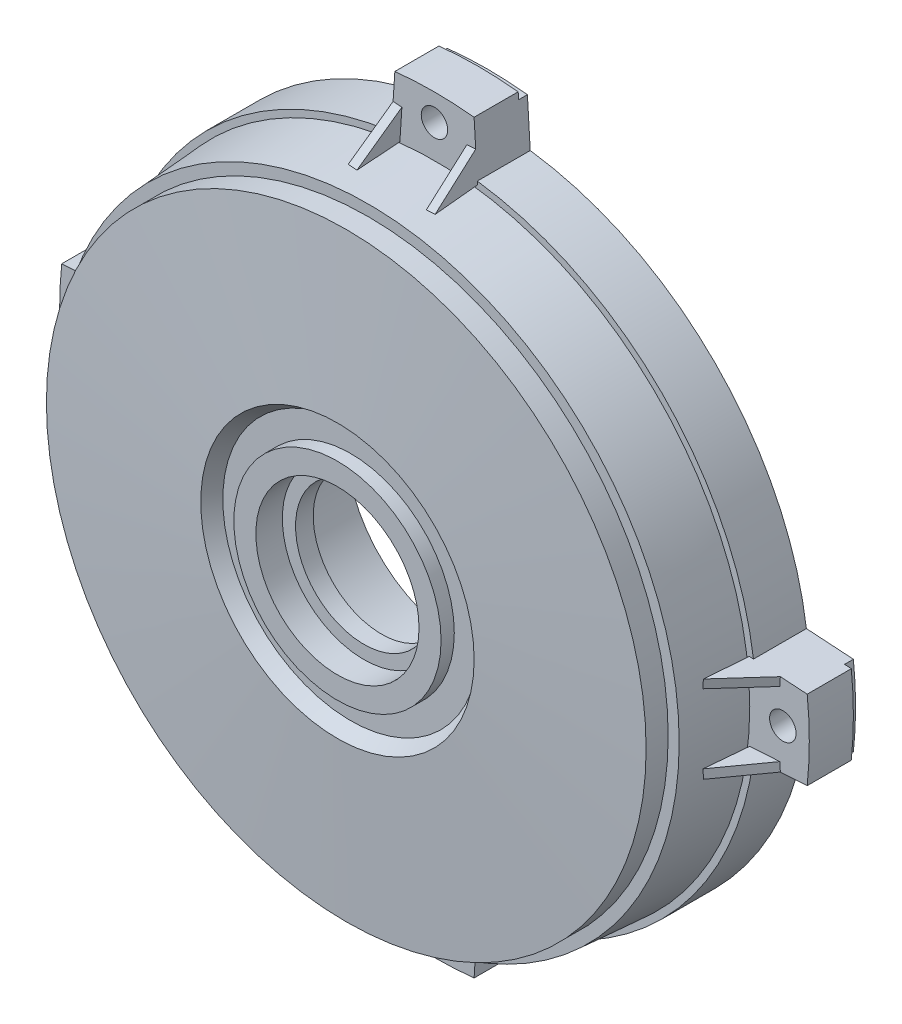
from build123d import *

# Parameters (mm, degrees)
SKETCH_2_R                = 70
CUT_EXTRUDE_1_DEPTH       = 4
EXTRUDE_1_DEPTH           = 12
PATTERN_CIRCULAR_1_COUNT  = 4
SKETCH_4_OUTSIDE_W        = 220.562
SKETCH_4_OUTSIDE_H        = 220.562
SKETCH_4_OUTSIDE_R        = 83.5
CUT_EXTRUDE_2_DEPTH       = 2
SKETCH_5_R                = 3
CUT_EXTRUDE_3_DEPTH       = 125.923976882
SKETCH_7_W                = 3
SKETCH_7_H                = 4
PATTERN_CIRCULAR_3_COUNT  = 8
SKETCH_8_R                = 5
EXTRUDE_2_DEPTH           = 22
PATTERN_CIRCULAR_4_COUNT  = 3
PATTERN_CIRCULAR_5_COUNT  = 3
EXTRUDE_3_DEPTH           = 2
PATTERN_CIRCULAR_7_COUNT  = 4
EXTRUDE_4_DEPTH           = 2
PATTERN_CIRCULAR_12_COUNT = 4


with BuildPart() as part:
    # Sketch 1 → Revolve 1 (revolve)
    with BuildSketch(Plane(origin=(0, 0, 0), x_dir=(1, 0, 0), z_dir=(0, 1, 0))):
        with BuildLine():
            Line((15.5, 5.088378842), (22.5, 5.088378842))
            Line((22.5, 5.088378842), (22.5, 6.088378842))
            Line((22.5, 6.088378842), (26, 6.088378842))
            Line((26, 6.088378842), (26, 23.088378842))
            Line((26, 23.088378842), (34, 23.088378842))
            Line((34, 23.088378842), (34, 4.03322004))
            ThreePointArc((34, 4.03322004), (35.561205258, 0.403524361), (39.26987629, -0.959491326))
            Line((39.26987629, -0.959491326), (64.5, 0.404299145))
            Line((64.5, 0.404299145), (64.5, 5.588378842))
            Line((64.5, 5.588378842), (67.233333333, 5.588378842))
            Line((67.233333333, 5.588378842), (70, 29.088378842))
            Line((70, 29.088378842), (73, 29.088378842))
            Line((73, 29.088378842), (73, 17.088378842))
            Line((73, 17.088378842), (71.5, 17.088378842))
            Line((71.5, 17.088378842), (70.5, 2.088378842))
            Line((70.5, 2.088378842), (68, 2.088378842))
            Line((68, 2.088378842), (68, -2.911621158))
            Line((68, -2.911621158), (31, -4.911621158))
            Line((31, -4.911621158), (29, -1.911621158))
            Line((29, -1.911621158), (23.5, -1.911621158))
            Line((23.5, -1.911621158), (23.5, -4.911621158))
            Line((23.5, -4.911621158), (18.5, -4.911621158))
            Line((18.5, -4.911621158), (18.5, 1.088378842))
            Line((18.5, 1.088378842), (15.5, 1.088378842))
            Line((15.5, 1.088378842), (15.5, 5.088378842))
        make_face()
    revolve(axis=Axis((0, 0, 0), (0, 0, -1)))

    # Sketch 2 → Cut-Extrude 1 (cut)
    with BuildSketch(Plane(origin=(0, 0, -29.088378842), x_dir=(-1, 0, 0), z_dir=(0, 0, -1))):
        Circle(SKETCH_2_R)
    extrude(amount=-CUT_EXTRUDE_1_DEPTH, mode=Mode.SUBTRACT)

    # Sketch 3 → Extrude 1 (add)
    with BuildSketch(Plane(origin=(0, 0, -29.088378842), x_dir=(-1, 0, 0), z_dir=(0, 0, -1))):
        with BuildLine():
            Line((-8.987378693, 84.523529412), (-9.900914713, 69.296261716))
            ThreePointArc((-9.900914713, 69.296261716), (0.037147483, 69.999990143), (9.974457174, 69.285714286))
            Line((9.974457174, 69.285714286), (8.987378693, 84.523529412))
            ThreePointArc((8.987378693, 84.523529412), (0, 85), (-8.987378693, 84.523529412))
        make_face()
    extrude_1 = extrude(amount=-EXTRUDE_1_DEPTH)

    # Pattern Circular 1: Extrude 1 ×4 about axis
    pattern_circular_1_axis = Axis((0, 0, 0), (0, 0, 1))
    for i in range(1, PATTERN_CIRCULAR_1_COUNT):
        add(extrude_1.rotate(pattern_circular_1_axis, i * 360 / PATTERN_CIRCULAR_1_COUNT))

    # Sketch 4 outside → Cut-Extrude 2 (cut)
    with BuildSketch(Plane(origin=(0, 0, -29.088378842), x_dir=(-1, 0, 0), z_dir=(0, 0, -1))):
        Rectangle(SKETCH_4_OUTSIDE_W, SKETCH_4_OUTSIDE_H)
        Circle(SKETCH_4_OUTSIDE_R, mode=Mode.SUBTRACT)
    extrude(amount=-CUT_EXTRUDE_2_DEPTH, mode=Mode.SUBTRACT)

    # Sketch 5 → Cut-Extrude 3 (cut, through all)
    with BuildSketch(Plane(origin=(0, 0, -29.088378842), x_dir=(-1, 0, 0), z_dir=(0, 0, -1))):
        with Locations((0, 79)):
            Circle(SKETCH_5_R)
        with Locations((79, 0)):
            Circle(SKETCH_5_R)
        with Locations((0, -79)):
            Circle(SKETCH_5_R)
        with Locations((-79, 0)):
            Circle(SKETCH_5_R)
    extrude(amount=-CUT_EXTRUDE_3_DEPTH, mode=Mode.SUBTRACT)

    # Sweep 1: sweep along a path in Sketch 6
    with BuildLine(Plane(origin=(0, 0, 0), x_dir=(1, 0, 0), z_dir=(0, 1, 0))) as sweep_1_path:
        Line((-64.546448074, 0.425171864), (-33.276692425, -1.405682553))
    # Sketch 7 → Sweep 1 (sweep)
    with BuildSketch(Plane(origin=(-64.546448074, 0, -0.425171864), x_dir=(0.058450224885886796, 0, -0.9982903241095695), z_dir=(0.9982903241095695, 0, 0.058450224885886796))):
        with Locations((1.406592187, 0)):
            Rectangle(SKETCH_7_W, SKETCH_7_H)
    sweep_1 = sweep(path=sweep_1_path.line)

    # Pattern Circular 3: Sweep 1 ×8 about axis
    pattern_circular_3_axis = Axis((0, 0, 0), (0, 0, 1))
    for i in range(1, PATTERN_CIRCULAR_3_COUNT):
        add(sweep_1.rotate(pattern_circular_3_axis, i * 360 / PATTERN_CIRCULAR_3_COUNT))

    # Sketch 8 → Extrude 2 (add)
    with BuildSketch(Plane(origin=(0, 0, -23.088378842), x_dir=(-1, 0, 0), z_dir=(0, 0, -1))):
        with Locations((0, 31)):
            Circle(SKETCH_8_R)
    extrude_2 = extrude(amount=-EXTRUDE_2_DEPTH)

    # Pattern Circular 4: Extrude 2 ×3 about axis
    pattern_circular_4_axis = Axis((0, 0, 0), (0, 0, 1))
    for i in range(1, PATTERN_CIRCULAR_4_COUNT):
        add(extrude_2.rotate(pattern_circular_4_axis, i * 360 / PATTERN_CIRCULAR_4_COUNT))

    # Cut-Extrude 4 cone 1 section (on through the dimple's axis) → Cut-Extrude 4 (revolve, cut)
    with BuildSketch(Plane(origin=(0, 31, -23.088378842), x_dir=(0, 1, 0), z_dir=(1, 0, 0))):
        Polygon((0, 0), (2.05, 0), (0, 2.05), align=None)
    cut_extrude_4 = revolve(axis=Axis((0, 31, -23.088378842), (0, 0, 1)), mode=Mode.SUBTRACT)

    # Pattern Circular 5: Cut-Extrude 4 ×3 about axis
    pattern_circular_5_axis = Axis((0, 0, 0), (0, 0, 1))
    for i in range(1, PATTERN_CIRCULAR_5_COUNT):
        add(cut_extrude_4.rotate(pattern_circular_5_axis, i * 360 / PATTERN_CIRCULAR_5_COUNT), mode=Mode.SUBTRACT)

    # Sketch 10 → Extrude 3 (add)
    with BuildSketch(Plane(origin=(14.00781804, 0.840377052, 0), x_dir=(0, 0, -1), z_dir=(0.9982052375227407, 0.05988575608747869, 0))):
        Polygon((17.088378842, 77.736057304), (7.414076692, 69.971826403), (17.088378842, 70.902485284), align=None)
    extrude_3 = extrude(amount=-EXTRUDE_3_DEPTH)

    # Pattern Circular 7: Extrude 3 ×4 about axis
    pattern_circular_7_axis = Axis((0, 0, 0), (0, 0, 1))
    for i in range(1, PATTERN_CIRCULAR_7_COUNT):
        add(extrude_3.rotate(pattern_circular_7_axis, i * 360 / PATTERN_CIRCULAR_7_COUNT))

    # Sketch 11 → Extrude 4 (add)
    with BuildSketch(Plane(origin=(-14.40222727, 0.93295059, 0), x_dir=(0, 0, 1), z_dir=(-0.9979084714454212, 0.06464273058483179, 0))):
        Polygon((-17.088378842, 77.662440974), (-17.088378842, 70.621449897), (-7.408481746, 69.88030249), align=None)
    extrude_4 = extrude(amount=-EXTRUDE_4_DEPTH)

    # Pattern Circular 12: Extrude 4 ×4 about axis
    pattern_circular_12_axis = Axis((0, 0, 0), (0, 0, 1))
    for i in range(1, PATTERN_CIRCULAR_12_COUNT):
        add(extrude_4.rotate(pattern_circular_12_axis, i * 360 / PATTERN_CIRCULAR_12_COUNT))


solid = part.part
